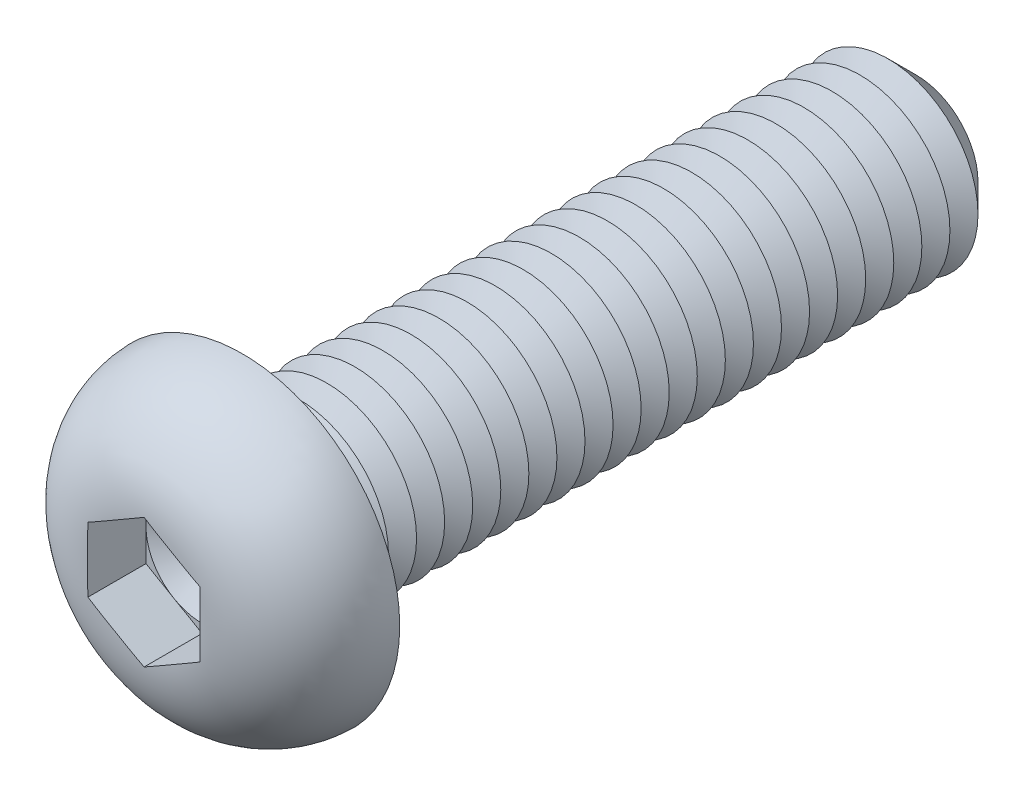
from build123d import *

# Parameters (mm, degrees)
CUT_EXTRUDE1_DEPTH  = 2.6
SKETCH4_R           = 4
BOSS_EXTRUDE1_DEPTH = 30
CHAMFER1_SIZE       = 1.25
LPATTERN1_COUNT     = 22
LPATTERN1_PITCH     = 1.25
FILLET2_R           = 0.5


with BuildPart() as part:
    # Sketch2 → Revolve1 (revolve)
    with BuildSketch(Plane(origin=(0, 0, 0), x_dir=(0, 0, -1), z_dir=(1, 0, 0)), mode=Mode.PRIVATE) as revolve1_sk:
        with BuildLine():
            Line((0, 0), (-4.4, 0))
            Line((-4.4, 0), (-4.4, 2.501111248))
            ThreePointArc((-4.4, 2.501111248), (-3.117141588, 5.647537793), (0, 7))
            Line((0, 7), (0, 0))
        make_face()
    revolve(revolve1_sk.sketch.rotate(Axis((0, 0, 47.934239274), (0, 0, -1)), 90), axis=Axis((0, 0, 47.934239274), (0, 0, -1)))

    # Sketch3 → Cut-Extrude1 (cut)
    with BuildSketch(Plane.XY.offset(4.4)):
        Polygon((0, 2.886751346), (-2.5, 1.443375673), (-2.5, -1.443375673), (0, -2.886751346), (2.5, -1.443375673), (2.5, 1.443375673), align=None)
    extrude(amount=-CUT_EXTRUDE1_DEPTH, mode=Mode.SUBTRACT)

    # Sketch4 → Boss-Extrude1 (add)
    with BuildSketch(Plane(origin=(0, 0, 0), x_dir=(-1, 0, 0), z_dir=(0, 0, -1))):
        with Locations(Location((0, 0, 0), (0, 0, 180))):
            Circle(SKETCH4_R)
    extrude(amount=BOSS_EXTRUDE1_DEPTH)

    # Chamfer1
    chamfer1_edges = [part.edges().sort_by_distance(p)[0] for p in [
        (-4, 0, -30),
    ]]
    chamfer(chamfer1_edges, length=CHAMFER1_SIZE)

    # Sketch5 → Cut-Revolve1 (revolve, cut)
    with BuildSketch(Plane(origin=(0, 0, 0), x_dir=(0, 0, -1), z_dir=(1, 0, 0)), mode=Mode.PRIVATE) as cut_revolve1_sk:
        Polygon((1.25, 4), (2.5, 4), (1.875, 2.917468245), align=None)
    cut_revolve1 = revolve(cut_revolve1_sk.sketch.rotate(Axis((0, 0, 47.934239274), (0, 0, -1)), 90), axis=Axis((0, 0, 47.934239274), (0, 0, -1)), mode=Mode.SUBTRACT)

    # LPattern1: Cut-Revolve1 ×22
    with Locations(*[(0, 0, -i * LPATTERN1_PITCH) for i in range(1, LPATTERN1_COUNT)]):
        add(cut_revolve1, mode=Mode.SUBTRACT)

    # Fillet2
    fillet2_edges = [part.edges().sort_by_distance(p)[0] for p in [
        (-4, 0, 0),
    ]]
    fillet(fillet2_edges, radius=FILLET2_R)

    # Cut-Extrude2 cone 1 section (on through the dimple's axis) → Cut-Extrude2 (revolve, cut)
    with BuildSketch(Plane(origin=(0, 0, 1.8), x_dir=(0, -1, 0), z_dir=(1, 0, 0))):
        Polygon((0, 0), (2.5, 0), (0, 1.443375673), align=None)
    revolve(axis=Axis((0, 0, 1.8), (0, 0, -1)), mode=Mode.SUBTRACT)


solid = part.part
